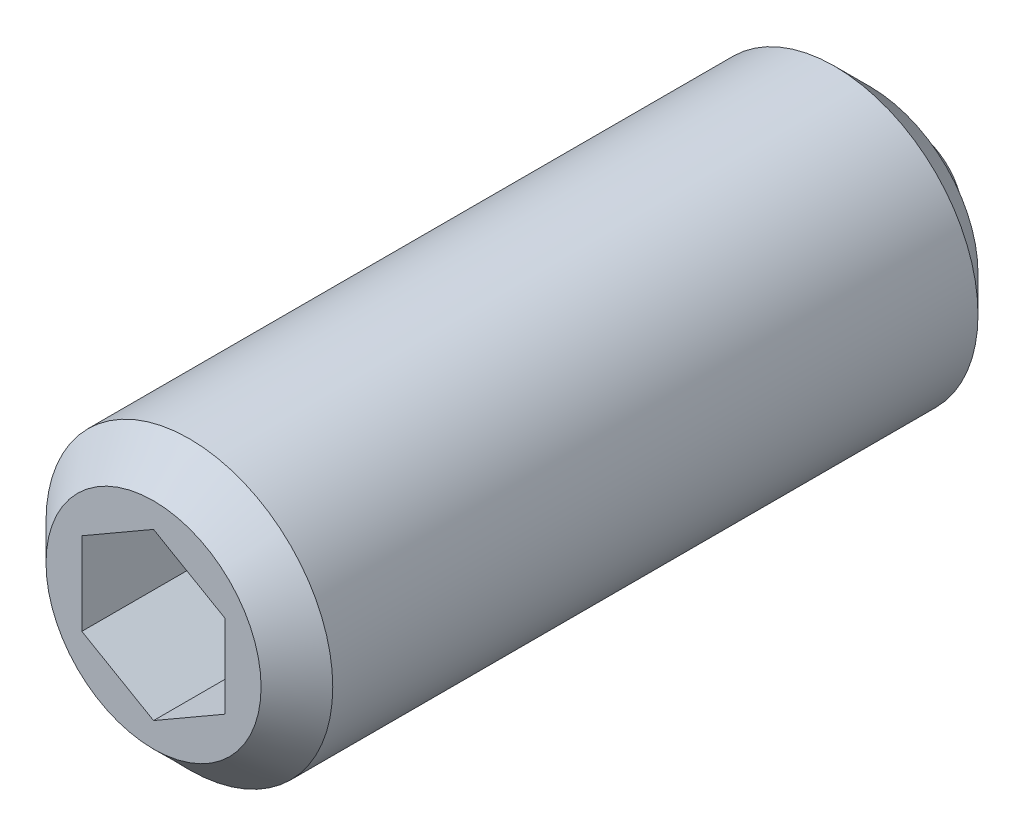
ISO-10303-21;
HEADER;
FILE_DESCRIPTION(('STEP AP214'),'2;1');
FILE_NAME('part.step','',(''),(''),'','','');
FILE_SCHEMA(('AUTOMOTIVE_DESIGN { 1 0 10303 214 1 1 1 1 }'));
ENDSEC;
DATA;
#1=APPLICATION_CONTEXT('core data for automotive mechanical design processes');
#2=APPLICATION_PROTOCOL_DEFINITION('international standard','automotive_design',2000,#1);
#3=PRODUCT_CONTEXT('',#1,'mechanical');
#4=PRODUCT('Part','Part','',(#3));
#5=PRODUCT_RELATED_PRODUCT_CATEGORY('part','',(#4));
#6=PRODUCT_DEFINITION_FORMATION('','',#4);
#7=PRODUCT_DEFINITION_CONTEXT('part definition',#1,'design');
#8=PRODUCT_DEFINITION('design','',#6,#7);
#9=PRODUCT_DEFINITION_SHAPE('','',#8);
#10=(LENGTH_UNIT() NAMED_UNIT(*) SI_UNIT(.MILLI.,.METRE.));
#11=(NAMED_UNIT(*) PLANE_ANGLE_UNIT() SI_UNIT($,.RADIAN.));
#12=(NAMED_UNIT(*) SI_UNIT($,.STERADIAN.) SOLID_ANGLE_UNIT());
#13=UNCERTAINTY_MEASURE_WITH_UNIT(LENGTH_MEASURE(1.E-05),#10,'distance_accuracy_value','');
#14=(GEOMETRIC_REPRESENTATION_CONTEXT(3) GLOBAL_UNCERTAINTY_ASSIGNED_CONTEXT((#13)) GLOBAL_UNIT_ASSIGNED_CONTEXT((#10,
#11,#12)) REPRESENTATION_CONTEXT('',''));
#15=CARTESIAN_POINT('',(0.,0.,0.));
#16=DIRECTION('',(0.,0.,1.));
#17=DIRECTION('',(1.,0.,0.));
#18=AXIS2_PLACEMENT_3D('',#15,#16,#17);
#19=CARTESIAN_POINT('',(0.,0.,10.8));
#20=DIRECTION('',(0.,0.,-1.));
#21=DIRECTION('',(0.,1.,0.));
#22=AXIS2_PLACEMENT_3D('',#19,#20,#21);
#23=PLANE('',#22);
#24=DIRECTION('',(0.866025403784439,0.5,0.));
#25=VECTOR('',#24,1.);
#26=CARTESIAN_POINT('',(0.,-1.15470053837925,10.8));
#27=LINE('',#26,#25);
#28=CARTESIAN_POINT('',(0.,-1.15470053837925,10.8));
#29=VERTEX_POINT('',#28);
#30=CARTESIAN_POINT('',(1.,-0.577350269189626,10.8));
#31=VERTEX_POINT('',#30);
#32=EDGE_CURVE('E110',#29,#31,#27,.T.);
#33=ORIENTED_EDGE('',*,*,#32,.F.);
#34=DIRECTION('',(0.866025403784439,-0.5,0.));
#35=VECTOR('',#34,1.);
#36=CARTESIAN_POINT('',(-1.,-0.577350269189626,10.8));
#37=LINE('',#36,#35);
#38=CARTESIAN_POINT('',(-1.,-0.577350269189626,10.8));
#39=VERTEX_POINT('',#38);
#40=EDGE_CURVE('E29',#39,#29,#37,.T.);
#41=ORIENTED_EDGE('',*,*,#40,.F.);
#42=DIRECTION('',(0.,-1.,0.));
#43=VECTOR('',#42,1.);
#44=CARTESIAN_POINT('',(-1.,0.577350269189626,10.8));
#45=LINE('',#44,#43);
#46=CARTESIAN_POINT('',(-1.,0.577350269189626,10.8));
#47=VERTEX_POINT('',#46);
#48=EDGE_CURVE('E124',#47,#39,#45,.T.);
#49=ORIENTED_EDGE('',*,*,#48,.F.);
#50=DIRECTION('',(-0.866025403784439,-0.5,0.));
#51=VECTOR('',#50,1.);
#52=CARTESIAN_POINT('',(0.,1.15470053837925,10.8));
#53=LINE('',#52,#51);
#54=CARTESIAN_POINT('',(0.,1.15470053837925,10.8));
#55=VERTEX_POINT('',#54);
#56=EDGE_CURVE('E121',#55,#47,#53,.T.);
#57=ORIENTED_EDGE('',*,*,#56,.F.);
#58=DIRECTION('',(-0.866025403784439,0.5,0.));
#59=VECTOR('',#58,1.);
#60=CARTESIAN_POINT('',(1.,0.577350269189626,10.8));
#61=LINE('',#60,#59);
#62=CARTESIAN_POINT('',(1.,0.577350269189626,10.8));
#63=VERTEX_POINT('',#62);
#64=EDGE_CURVE('E118',#63,#55,#61,.T.);
#65=ORIENTED_EDGE('',*,*,#64,.F.);
#66=DIRECTION('',(0.,1.,0.));
#67=VECTOR('',#66,1.);
#68=CARTESIAN_POINT('',(1.,-0.577350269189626,10.8));
#69=LINE('',#68,#67);
#70=EDGE_CURVE('E115',#31,#63,#69,.T.);
#71=ORIENTED_EDGE('',*,*,#70,.F.);
#72=EDGE_LOOP('',(#33,#41,#49,#57,#65,#71));
#73=FACE_BOUND('',#72,.T.);
#74=CARTESIAN_POINT('',(0.,0.,10.8));
#75=DIRECTION('',(0.,0.,-1.));
#76=DIRECTION('',(0.,1.,0.));
#77=AXIS2_PLACEMENT_3D('',#74,#75,#76);
#78=CIRCLE('',#77,1.5);
#79=CARTESIAN_POINT('',(0.,1.5,10.8));
#80=VERTEX_POINT('',#79);
#81=EDGE_CURVE('E22',#80,#80,#78,.F.);
#82=ORIENTED_EDGE('',*,*,#81,.T.);
#83=EDGE_LOOP('',(#82));
#84=FACE_BOUND('',#83,.T.);
#85=ADVANCED_FACE('F14',(#73,#84),#23,.F.);
#86=CARTESIAN_POINT('',(0.,0.,0.8));
#87=DIRECTION('',(0.,0.,1.));
#88=DIRECTION('',(0.,-1.,0.));
#89=AXIS2_PLACEMENT_3D('',#86,#87,#88);
#90=CYLINDRICAL_SURFACE('',#89,2.);
#91=CARTESIAN_POINT('',(0.,0.,10.3));
#92=DIRECTION('',(0.,0.,-1.));
#93=DIRECTION('',(0.,1.,0.));
#94=AXIS2_PLACEMENT_3D('',#91,#92,#93);
#95=CIRCLE('',#94,2.);
#96=CARTESIAN_POINT('',(0.,2.,10.3));
#97=VERTEX_POINT('',#96);
#98=EDGE_CURVE('E83',#97,#97,#95,.T.);
#99=ORIENTED_EDGE('',*,*,#98,.T.);
#100=EDGE_LOOP('',(#99));
#101=FACE_BOUND('',#100,.T.);
#102=CARTESIAN_POINT('',(0.,0.,1.3));
#103=DIRECTION('',(0.,0.,-1.));
#104=DIRECTION('',(-1.,0.,0.));
#105=AXIS2_PLACEMENT_3D('',#102,#103,#104);
#106=CIRCLE('',#105,2.);
#107=CARTESIAN_POINT('',(-2.,0.,1.3));
#108=VERTEX_POINT('',#107);
#109=EDGE_CURVE('E107',#108,#108,#106,.T.);
#110=ORIENTED_EDGE('',*,*,#109,.F.);
#111=EDGE_LOOP('',(#110));
#112=FACE_BOUND('',#111,.T.);
#113=ADVANCED_FACE('F16',(#101,#112),#90,.T.);
#114=CARTESIAN_POINT('',(0.,0.,10.3));
#115=DIRECTION('',(0.,0.,-1.));
#116=DIRECTION('',(0.,1.,0.));
#117=AXIS2_PLACEMENT_3D('',#114,#115,#116);
#118=CONICAL_SURFACE('',#117,2.,0.78539816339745);
#119=ORIENTED_EDGE('',*,*,#81,.F.);
#120=EDGE_LOOP('',(#119));
#121=FACE_BOUND('',#120,.T.);
#122=ORIENTED_EDGE('',*,*,#98,.F.);
#123=EDGE_LOOP('',(#122));
#124=FACE_BOUND('',#123,.T.);
#125=ADVANCED_FACE('F96',(#121,#124),#118,.T.);
#126=CARTESIAN_POINT('',(-1.,-0.577350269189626,8.8));
#127=DIRECTION('',(-0.5,-0.866025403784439,0.));
#128=DIRECTION('',(-0.866025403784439,0.5,0.));
#129=AXIS2_PLACEMENT_3D('',#126,#127,#128);
#130=PLANE('',#129);
#131=ORIENTED_EDGE('',*,*,#40,.T.);
#132=DIRECTION('',(0.,0.,1.));
#133=VECTOR('',#132,1.);
#134=CARTESIAN_POINT('',(0.,-1.15470053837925,8.8));
#135=LINE('',#134,#133);
#136=CARTESIAN_POINT('',(0.,-1.15470053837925,8.8));
#137=VERTEX_POINT('',#136);
#138=EDGE_CURVE('E90',#137,#29,#135,.T.);
#139=ORIENTED_EDGE('',*,*,#138,.F.);
#140=DIRECTION('',(0.866025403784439,-0.5,0.));
#141=VECTOR('',#140,1.);
#142=CARTESIAN_POINT('',(-1.,-0.577350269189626,8.8));
#143=LINE('',#142,#141);
#144=CARTESIAN_POINT('',(-1.,-0.577350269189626,8.8));
#145=VERTEX_POINT('',#144);
#146=EDGE_CURVE('E126',#145,#137,#143,.T.);
#147=ORIENTED_EDGE('',*,*,#146,.F.);
#148=DIRECTION('',(0.,0.,1.));
#149=VECTOR('',#148,1.);
#150=CARTESIAN_POINT('',(-1.,-0.577350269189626,8.8));
#151=LINE('',#150,#149);
#152=EDGE_CURVE('E36',#145,#39,#151,.T.);
#153=ORIENTED_EDGE('',*,*,#152,.T.);
#154=EDGE_LOOP('',(#131,#139,#147,#153));
#155=FACE_BOUND('',#154,.T.);
#156=ADVANCED_FACE('F99',(#155),#130,.F.);
#157=CARTESIAN_POINT('',(-1.,0.577350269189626,8.8));
#158=DIRECTION('',(-1.,0.,0.));
#159=DIRECTION('',(0.,1.,0.));
#160=AXIS2_PLACEMENT_3D('',#157,#158,#159);
#161=PLANE('',#160);
#162=ORIENTED_EDGE('',*,*,#48,.T.);
#163=ORIENTED_EDGE('',*,*,#152,.F.);
#164=DIRECTION('',(0.,-1.,0.));
#165=VECTOR('',#164,1.);
#166=CARTESIAN_POINT('',(-1.,0.577350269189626,8.8));
#167=LINE('',#166,#165);
#168=CARTESIAN_POINT('',(-1.,0.577350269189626,8.8));
#169=VERTEX_POINT('',#168);
#170=EDGE_CURVE('E141',#169,#145,#167,.T.);
#171=ORIENTED_EDGE('',*,*,#170,.F.);
#172=DIRECTION('',(0.,0.,1.));
#173=VECTOR('',#172,1.);
#174=CARTESIAN_POINT('',(-1.,0.577350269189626,8.8));
#175=LINE('',#174,#173);
#176=EDGE_CURVE('E87',#169,#47,#175,.T.);
#177=ORIENTED_EDGE('',*,*,#176,.T.);
#178=EDGE_LOOP('',(#162,#163,#171,#177));
#179=FACE_BOUND('',#178,.T.);
#180=ADVANCED_FACE('F167',(#179),#161,.F.);
#181=CARTESIAN_POINT('',(0.,1.15470053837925,8.8));
#182=DIRECTION('',(-0.5,0.866025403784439,0.));
#183=DIRECTION('',(0.866025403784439,0.5,0.));
#184=AXIS2_PLACEMENT_3D('',#181,#182,#183);
#185=PLANE('',#184);
#186=ORIENTED_EDGE('',*,*,#56,.T.);
#187=ORIENTED_EDGE('',*,*,#176,.F.);
#188=DIRECTION('',(-0.866025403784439,-0.5,0.));
#189=VECTOR('',#188,1.);
#190=CARTESIAN_POINT('',(0.,1.15470053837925,8.8));
#191=LINE('',#190,#189);
#192=CARTESIAN_POINT('',(0.,1.15470053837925,8.8));
#193=VERTEX_POINT('',#192);
#194=EDGE_CURVE('E138',#193,#169,#191,.T.);
#195=ORIENTED_EDGE('',*,*,#194,.F.);
#196=DIRECTION('',(0.,0.,1.));
#197=VECTOR('',#196,1.);
#198=CARTESIAN_POINT('',(0.,1.15470053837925,8.8));
#199=LINE('',#198,#197);
#200=EDGE_CURVE('E145',#193,#55,#199,.T.);
#201=ORIENTED_EDGE('',*,*,#200,.T.);
#202=EDGE_LOOP('',(#186,#187,#195,#201));
#203=FACE_BOUND('',#202,.T.);
#204=ADVANCED_FACE('F169',(#203),#185,.F.);
#205=CARTESIAN_POINT('',(1.,0.577350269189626,8.8));
#206=DIRECTION('',(0.5,0.866025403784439,0.));
#207=DIRECTION('',(0.866025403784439,-0.5,0.));
#208=AXIS2_PLACEMENT_3D('',#205,#206,#207);
#209=PLANE('',#208);
#210=ORIENTED_EDGE('',*,*,#64,.T.);
#211=ORIENTED_EDGE('',*,*,#200,.F.);
#212=DIRECTION('',(-0.866025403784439,0.5,0.));
#213=VECTOR('',#212,1.);
#214=CARTESIAN_POINT('',(1.,0.577350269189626,8.8));
#215=LINE('',#214,#213);
#216=CARTESIAN_POINT('',(1.,0.577350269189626,8.8));
#217=VERTEX_POINT('',#216);
#218=EDGE_CURVE('E135',#217,#193,#215,.T.);
#219=ORIENTED_EDGE('',*,*,#218,.F.);
#220=DIRECTION('',(0.,0.,1.));
#221=VECTOR('',#220,1.);
#222=CARTESIAN_POINT('',(1.,0.577350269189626,8.8));
#223=LINE('',#222,#221);
#224=EDGE_CURVE('E147',#217,#63,#223,.T.);
#225=ORIENTED_EDGE('',*,*,#224,.T.);
#226=EDGE_LOOP('',(#210,#211,#219,#225));
#227=FACE_BOUND('',#226,.T.);
#228=ADVANCED_FACE('F163',(#227),#209,.F.);
#229=CARTESIAN_POINT('',(1.,-0.577350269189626,8.8));
#230=DIRECTION('',(1.,0.,0.));
#231=DIRECTION('',(0.,-1.,0.));
#232=AXIS2_PLACEMENT_3D('',#229,#230,#231);
#233=PLANE('',#232);
#234=ORIENTED_EDGE('',*,*,#70,.T.);
#235=ORIENTED_EDGE('',*,*,#224,.F.);
#236=DIRECTION('',(0.,1.,0.));
#237=VECTOR('',#236,1.);
#238=CARTESIAN_POINT('',(1.,-0.577350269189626,8.8));
#239=LINE('',#238,#237);
#240=CARTESIAN_POINT('',(1.,-0.577350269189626,8.8));
#241=VERTEX_POINT('',#240);
#242=EDGE_CURVE('E132',#241,#217,#239,.T.);
#243=ORIENTED_EDGE('',*,*,#242,.F.);
#244=DIRECTION('',(0.,0.,1.));
#245=VECTOR('',#244,1.);
#246=CARTESIAN_POINT('',(1.,-0.577350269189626,8.8));
#247=LINE('',#246,#245);
#248=EDGE_CURVE('E148',#241,#31,#247,.T.);
#249=ORIENTED_EDGE('',*,*,#248,.T.);
#250=EDGE_LOOP('',(#234,#235,#243,#249));
#251=FACE_BOUND('',#250,.T.);
#252=ADVANCED_FACE('F160',(#251),#233,.F.);
#253=CARTESIAN_POINT('',(0.,-1.15470053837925,8.8));
#254=DIRECTION('',(0.5,-0.866025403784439,0.));
#255=DIRECTION('',(-0.866025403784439,-0.5,0.));
#256=AXIS2_PLACEMENT_3D('',#253,#254,#255);
#257=PLANE('',#256);
#258=ORIENTED_EDGE('',*,*,#32,.T.);
#259=ORIENTED_EDGE('',*,*,#248,.F.);
#260=DIRECTION('',(0.866025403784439,0.5,0.));
#261=VECTOR('',#260,1.);
#262=CARTESIAN_POINT('',(0.,-1.15470053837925,8.8));
#263=LINE('',#262,#261);
#264=EDGE_CURVE('E129',#137,#241,#263,.T.);
#265=ORIENTED_EDGE('',*,*,#264,.F.);
#266=ORIENTED_EDGE('',*,*,#138,.T.);
#267=EDGE_LOOP('',(#258,#259,#265,#266));
#268=FACE_BOUND('',#267,.T.);
#269=ADVANCED_FACE('F154',(#268),#257,.F.);
#270=CARTESIAN_POINT('',(-1.,-0.577350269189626,8.8));
#271=DIRECTION('',(0.,0.,-1.));
#272=DIRECTION('',(0.,1.,0.));
#273=AXIS2_PLACEMENT_3D('',#270,#271,#272);
#274=PLANE('',#273);
#275=ORIENTED_EDGE('',*,*,#146,.T.);
#276=ORIENTED_EDGE('',*,*,#264,.T.);
#277=ORIENTED_EDGE('',*,*,#242,.T.);
#278=ORIENTED_EDGE('',*,*,#218,.T.);
#279=ORIENTED_EDGE('',*,*,#194,.T.);
#280=ORIENTED_EDGE('',*,*,#170,.T.);
#281=EDGE_LOOP('',(#275,#276,#277,#278,#279,#280));
#282=FACE_BOUND('',#281,.T.);
#283=ADVANCED_FACE('F166',(#282),#274,.F.);
#284=CARTESIAN_POINT('',(0.,0.,0.8));
#285=DIRECTION('',(0.,0.,1.));
#286=DIRECTION('',(1.,0.,0.));
#287=AXIS2_PLACEMENT_3D('',#284,#285,#286);
#288=CONICAL_SURFACE('',#287,1.5,0.785398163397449);
#289=ORIENTED_EDGE('',*,*,#109,.T.);
#290=EDGE_LOOP('',(#289));
#291=FACE_BOUND('',#290,.T.);
#292=CARTESIAN_POINT('',(0.,0.,0.8));
#293=DIRECTION('',(0.,0.,-1.));
#294=DIRECTION('',(0.,1.,0.));
#295=AXIS2_PLACEMENT_3D('',#292,#293,#294);
#296=CIRCLE('',#295,1.5);
#297=CARTESIAN_POINT('',(0.,1.5,0.8));
#298=VERTEX_POINT('',#297);
#299=EDGE_CURVE('E81',#298,#298,#296,.F.);
#300=ORIENTED_EDGE('',*,*,#299,.T.);
#301=EDGE_LOOP('',(#300));
#302=FACE_BOUND('',#301,.T.);
#303=ADVANCED_FACE('F78',(#291,#302),#288,.T.);
#304=CARTESIAN_POINT('',(0.,0.,0.8));
#305=DIRECTION('',(0.,0.,-1.));
#306=DIRECTION('',(0.,1.,0.));
#307=AXIS2_PLACEMENT_3D('',#304,#305,#306);
#308=PLANE('',#307);
#309=CARTESIAN_POINT('',(0.,0.,0.8));
#310=DIRECTION('',(0.,0.,-1.));
#311=DIRECTION('',(-1.,0.,0.));
#312=AXIS2_PLACEMENT_3D('',#309,#310,#311);
#313=CIRCLE('',#312,1.16619037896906);
#314=CARTESIAN_POINT('',(-1.16619037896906,0.,0.8));
#315=VERTEX_POINT('',#314);
#316=EDGE_CURVE('E9',#315,#315,#313,.T.);
#317=ORIENTED_EDGE('',*,*,#316,.F.);
#318=EDGE_LOOP('',(#317));
#319=FACE_BOUND('',#318,.T.);
#320=ORIENTED_EDGE('',*,*,#299,.F.);
#321=EDGE_LOOP('',(#320));
#322=FACE_BOUND('',#321,.T.);
#323=ADVANCED_FACE('F72',(#319,#322),#308,.T.);
#324=CARTESIAN_POINT('',(0.,0.,1.25));
#325=DIRECTION('',(0.,0.,-1.));
#326=DIRECTION('',(-1.,0.,0.));
#327=AXIS2_PLACEMENT_3D('',#324,#325,#326);
#328=SPHERICAL_SURFACE('',#327,1.25);
#329=CARTESIAN_POINT('',(0.,0.,0.));
#330=VERTEX_POINT('',#329);
#331=VERTEX_LOOP('',#330);
#332=FACE_BOUND('',#331,.T.);
#333=ORIENTED_EDGE('',*,*,#316,.T.);
#334=EDGE_LOOP('',(#333));
#335=FACE_BOUND('',#334,.T.);
#336=ADVANCED_FACE('F69',(#332,#335),#328,.T.);
#337=CLOSED_SHELL('',(#85,#113,#125,#156,#180,#204,#228,#252,#269,#283,#303,#323,#336));
#338=MANIFOLD_SOLID_BREP('B1',#337);
#339=ADVANCED_BREP_SHAPE_REPRESENTATION('',(#18,#338),#14);
#340=SHAPE_DEFINITION_REPRESENTATION(#9,#339);
ENDSEC;
END-ISO-10303-21;
